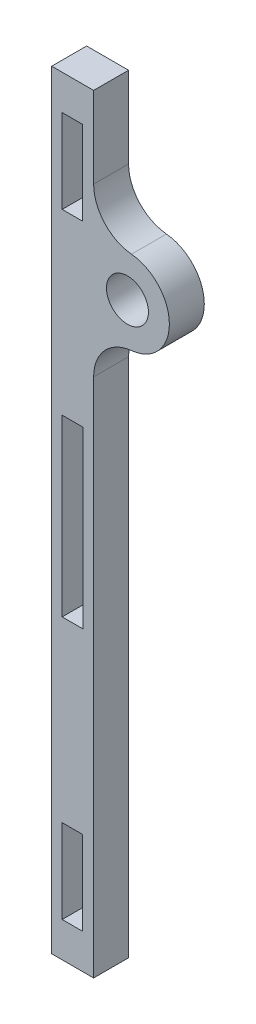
ISO-10303-21;
HEADER;
FILE_DESCRIPTION(('STEP AP214'),'2;1');
FILE_NAME('part.step','',(''),(''),'','','');
FILE_SCHEMA(('AUTOMOTIVE_DESIGN { 1 0 10303 214 1 1 1 1 }'));
ENDSEC;
DATA;
#1=APPLICATION_CONTEXT('core data for automotive mechanical design processes');
#2=APPLICATION_PROTOCOL_DEFINITION('international standard','automotive_design',2000,#1);
#3=PRODUCT_CONTEXT('',#1,'mechanical');
#4=PRODUCT('Part','Part','',(#3));
#5=PRODUCT_RELATED_PRODUCT_CATEGORY('part','',(#4));
#6=PRODUCT_DEFINITION_FORMATION('','',#4);
#7=PRODUCT_DEFINITION_CONTEXT('part definition',#1,'design');
#8=PRODUCT_DEFINITION('design','',#6,#7);
#9=PRODUCT_DEFINITION_SHAPE('','',#8);
#10=(LENGTH_UNIT() NAMED_UNIT(*) SI_UNIT(.MILLI.,.METRE.));
#11=(NAMED_UNIT(*) PLANE_ANGLE_UNIT() SI_UNIT($,.RADIAN.));
#12=(NAMED_UNIT(*) SI_UNIT($,.STERADIAN.) SOLID_ANGLE_UNIT());
#13=UNCERTAINTY_MEASURE_WITH_UNIT(LENGTH_MEASURE(1.E-05),#10,'distance_accuracy_value','');
#14=(GEOMETRIC_REPRESENTATION_CONTEXT(3) GLOBAL_UNCERTAINTY_ASSIGNED_CONTEXT((#13)) GLOBAL_UNIT_ASSIGNED_CONTEXT((#10,
#11,#12)) REPRESENTATION_CONTEXT('',''));
#15=CARTESIAN_POINT('',(0.,0.,0.));
#16=DIRECTION('',(0.,0.,1.));
#17=DIRECTION('',(1.,0.,0.));
#18=AXIS2_PLACEMENT_3D('',#15,#16,#17);
#19=CARTESIAN_POINT('',(-213.099771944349,-16.4582239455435,5.));
#20=DIRECTION('',(0.,0.,1.));
#21=DIRECTION('',(1.,0.,0.));
#22=AXIS2_PLACEMENT_3D('',#19,#20,#21);
#23=PLANE('',#22);
#24=DIRECTION('',(0.,-1.,0.));
#25=VECTOR('',#24,1.);
#26=CARTESIAN_POINT('',(-223.599771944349,-23.4517190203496,5.));
#27=LINE('',#26,#25);
#28=CARTESIAN_POINT('',(-223.599771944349,-23.4517190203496,5.));
#29=VERTEX_POINT('',#28);
#30=CARTESIAN_POINT('',(-223.599771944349,-48.4517190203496,5.));
#31=VERTEX_POINT('',#30);
#32=EDGE_CURVE('E178',#29,#31,#27,.T.);
#33=ORIENTED_EDGE('',*,*,#32,.F.);
#34=DIRECTION('',(-1.,0.,0.));
#35=VECTOR('',#34,1.);
#36=CARTESIAN_POINT('',(-220.599771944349,-23.4517190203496,5.));
#37=LINE('',#36,#35);
#38=CARTESIAN_POINT('',(-220.599771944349,-23.4517190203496,5.));
#39=VERTEX_POINT('',#38);
#40=EDGE_CURVE('E170',#39,#29,#37,.T.);
#41=ORIENTED_EDGE('',*,*,#40,.F.);
#42=DIRECTION('',(0.,1.,0.));
#43=VECTOR('',#42,1.);
#44=CARTESIAN_POINT('',(-220.599771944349,-48.4517190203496,5.));
#45=LINE('',#44,#43);
#46=CARTESIAN_POINT('',(-220.599771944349,-48.4517190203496,5.));
#47=VERTEX_POINT('',#46);
#48=EDGE_CURVE('E193',#47,#39,#45,.T.);
#49=ORIENTED_EDGE('',*,*,#48,.F.);
#50=DIRECTION('',(1.,0.,0.));
#51=VECTOR('',#50,1.);
#52=CARTESIAN_POINT('',(-223.599771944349,-48.4517190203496,5.));
#53=LINE('',#52,#51);
#54=EDGE_CURVE('E191',#31,#47,#53,.T.);
#55=ORIENTED_EDGE('',*,*,#54,.F.);
#56=EDGE_LOOP('',(#33,#41,#49,#55));
#57=FACE_BOUND('',#56,.T.);
#58=DIRECTION('',(1.,0.,0.));
#59=VECTOR('',#58,1.);
#60=CARTESIAN_POINT('',(-223.599771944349,2.04828097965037,5.));
#61=LINE('',#60,#59);
#62=CARTESIAN_POINT('',(-223.599771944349,2.04828097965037,5.));
#63=VERTEX_POINT('',#62);
#64=CARTESIAN_POINT('',(-220.699771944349,2.04828097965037,5.));
#65=VERTEX_POINT('',#64);
#66=EDGE_CURVE('E242',#63,#65,#61,.T.);
#67=ORIENTED_EDGE('',*,*,#66,.F.);
#68=DIRECTION('',(0.,-1.,0.));
#69=VECTOR('',#68,1.);
#70=CARTESIAN_POINT('',(-223.599771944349,14.0482809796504,5.));
#71=LINE('',#70,#69);
#72=CARTESIAN_POINT('',(-223.599771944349,14.0482809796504,5.));
#73=VERTEX_POINT('',#72);
#74=EDGE_CURVE('E240',#73,#63,#71,.T.);
#75=ORIENTED_EDGE('',*,*,#74,.F.);
#76=DIRECTION('',(-1.,0.,0.));
#77=VECTOR('',#76,1.);
#78=CARTESIAN_POINT('',(-223.599771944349,14.0482809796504,5.));
#79=LINE('',#78,#77);
#80=CARTESIAN_POINT('',(-220.699771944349,14.0482809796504,5.));
#81=VERTEX_POINT('',#80);
#82=EDGE_CURVE('E248',#81,#73,#79,.T.);
#83=ORIENTED_EDGE('',*,*,#82,.F.);
#84=DIRECTION('',(0.,1.,0.));
#85=VECTOR('',#84,1.);
#86=CARTESIAN_POINT('',(-220.699771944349,14.0482809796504,5.));
#87=LINE('',#86,#85);
#88=EDGE_CURVE('E245',#65,#81,#87,.T.);
#89=ORIENTED_EDGE('',*,*,#88,.F.);
#90=EDGE_LOOP('',(#67,#75,#83,#89));
#91=FACE_BOUND('',#90,.T.);
#92=DIRECTION('',(0.,-1.,0.));
#93=VECTOR('',#92,1.);
#94=CARTESIAN_POINT('',(-225.099771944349,19.0482809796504,5.));
#95=LINE('',#94,#93);
#96=CARTESIAN_POINT('',(-225.099771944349,19.0482809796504,5.));
#97=VERTEX_POINT('',#96);
#98=CARTESIAN_POINT('',(-225.099771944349,-90.9517190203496,5.));
#99=VERTEX_POINT('',#98);
#100=EDGE_CURVE('E271',#97,#99,#95,.T.);
#101=ORIENTED_EDGE('',*,*,#100,.T.);
#102=DIRECTION('',(1.,0.,0.));
#103=VECTOR('',#102,1.);
#104=CARTESIAN_POINT('',(-225.099771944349,-90.9517190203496,5.));
#105=LINE('',#104,#103);
#106=CARTESIAN_POINT('',(-219.099771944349,-90.9517190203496,5.));
#107=VERTEX_POINT('',#106);
#108=EDGE_CURVE('E274',#99,#107,#105,.T.);
#109=ORIENTED_EDGE('',*,*,#108,.T.);
#110=DIRECTION('',(0.,1.,0.));
#111=VECTOR('',#110,1.);
#112=CARTESIAN_POINT('',(-219.099771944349,-16.4582239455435,5.));
#113=LINE('',#112,#111);
#114=CARTESIAN_POINT('',(-219.099771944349,-16.4582239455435,5.));
#115=VERTEX_POINT('',#114);
#116=EDGE_CURVE('E277',#107,#115,#113,.T.);
#117=ORIENTED_EDGE('',*,*,#116,.T.);
#118=CARTESIAN_POINT('',(-213.099771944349,-16.4582239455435,5.));
#119=DIRECTION('',(0.,0.,-1.));
#120=DIRECTION('',(1.,0.,0.));
#121=AXIS2_PLACEMENT_3D('',#118,#119,#120);
#122=CIRCLE('',#121,6.);
#123=CARTESIAN_POINT('',(-213.680334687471,-10.4863777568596,5.));
#124=VERTEX_POINT('',#123);
#125=EDGE_CURVE('E279',#115,#124,#122,.T.);
#126=ORIENTED_EDGE('',*,*,#125,.T.);
#127=CARTESIAN_POINT('',(-214.260897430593,-4.51453156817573,5.));
#128=DIRECTION('',(0.,0.,1.));
#129=DIRECTION('',(1.,0.,0.));
#130=AXIS2_PLACEMENT_3D('',#127,#128,#129);
#131=CIRCLE('',#130,6.);
#132=CARTESIAN_POINT('',(-213.680334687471,1.45731462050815,5.));
#133=VERTEX_POINT('',#132);
#134=EDGE_CURVE('E281',#124,#133,#131,.T.);
#135=ORIENTED_EDGE('',*,*,#134,.T.);
#136=CARTESIAN_POINT('',(-213.099771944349,7.42916080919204,5.));
#137=DIRECTION('',(0.,0.,-1.));
#138=DIRECTION('',(-1.,0.,0.));
#139=AXIS2_PLACEMENT_3D('',#136,#137,#138);
#140=CIRCLE('',#139,6.);
#141=CARTESIAN_POINT('',(-219.099771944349,7.42916080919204,5.));
#142=VERTEX_POINT('',#141);
#143=EDGE_CURVE('E283',#133,#142,#140,.T.);
#144=ORIENTED_EDGE('',*,*,#143,.T.);
#145=DIRECTION('',(0.,1.,0.));
#146=VECTOR('',#145,1.);
#147=CARTESIAN_POINT('',(-219.099771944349,19.0482809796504,5.));
#148=LINE('',#147,#146);
#149=CARTESIAN_POINT('',(-219.099771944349,19.0482809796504,5.));
#150=VERTEX_POINT('',#149);
#151=EDGE_CURVE('E285',#142,#150,#148,.T.);
#152=ORIENTED_EDGE('',*,*,#151,.T.);
#153=DIRECTION('',(-1.,0.,0.));
#154=VECTOR('',#153,1.);
#155=CARTESIAN_POINT('',(-225.099771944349,19.0482809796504,5.));
#156=LINE('',#155,#154);
#157=EDGE_CURVE('E287',#150,#97,#156,.T.);
#158=ORIENTED_EDGE('',*,*,#157,.T.);
#159=EDGE_LOOP('',(#101,#109,#117,#126,#135,#144,#152,#158));
#160=FACE_BOUND('',#159,.T.);
#161=DIRECTION('',(1.,0.,0.));
#162=VECTOR('',#161,1.);
#163=CARTESIAN_POINT('',(-223.599771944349,-85.9517190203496,5.));
#164=LINE('',#163,#162);
#165=CARTESIAN_POINT('',(-223.599771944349,-85.9517190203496,5.));
#166=VERTEX_POINT('',#165);
#167=CARTESIAN_POINT('',(-220.699771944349,-85.9517190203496,5.));
#168=VERTEX_POINT('',#167);
#169=EDGE_CURVE('E211',#166,#168,#164,.T.);
#170=ORIENTED_EDGE('',*,*,#169,.F.);
#171=DIRECTION('',(0.,-1.,0.));
#172=VECTOR('',#171,1.);
#173=CARTESIAN_POINT('',(-223.599771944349,-73.9517190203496,5.));
#174=LINE('',#173,#172);
#175=CARTESIAN_POINT('',(-223.599771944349,-73.9517190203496,5.));
#176=VERTEX_POINT('',#175);
#177=EDGE_CURVE('E209',#176,#166,#174,.T.);
#178=ORIENTED_EDGE('',*,*,#177,.F.);
#179=DIRECTION('',(-1.,0.,0.));
#180=VECTOR('',#179,1.);
#181=CARTESIAN_POINT('',(-223.599771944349,-73.9517190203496,5.));
#182=LINE('',#181,#180);
#183=CARTESIAN_POINT('',(-220.699771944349,-73.9517190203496,5.));
#184=VERTEX_POINT('',#183);
#185=EDGE_CURVE('E217',#184,#176,#182,.T.);
#186=ORIENTED_EDGE('',*,*,#185,.F.);
#187=DIRECTION('',(0.,1.,0.));
#188=VECTOR('',#187,1.);
#189=CARTESIAN_POINT('',(-220.699771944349,-73.9517190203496,5.));
#190=LINE('',#189,#188);
#191=EDGE_CURVE('E214',#168,#184,#190,.T.);
#192=ORIENTED_EDGE('',*,*,#191,.F.);
#193=EDGE_LOOP('',(#170,#178,#186,#192));
#194=FACE_BOUND('',#193,.T.);
#195=CARTESIAN_POINT('',(-214.260897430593,-4.51453156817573,5.));
#196=DIRECTION('',(0.,0.,1.));
#197=DIRECTION('',(1.,0.,0.));
#198=AXIS2_PLACEMENT_3D('',#195,#196,#197);
#199=CIRCLE('',#198,2.99999999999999);
#200=CARTESIAN_POINT('',(-211.260897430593,-4.51453156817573,5.));
#201=VERTEX_POINT('',#200);
#202=EDGE_CURVE('E199',#201,#201,#199,.T.);
#203=ORIENTED_EDGE('',*,*,#202,.F.);
#204=EDGE_LOOP('',(#203));
#205=FACE_BOUND('',#204,.T.);
#206=ADVANCED_FACE('F33',(#57,#91,#160,#194,#205),#23,.T.);
#207=CARTESIAN_POINT('',(-213.099771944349,-16.4582239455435,0.));
#208=DIRECTION('',(0.,0.,1.));
#209=DIRECTION('',(1.,0.,0.));
#210=AXIS2_PLACEMENT_3D('',#207,#208,#209);
#211=PLANE('',#210);
#212=DIRECTION('',(-1.,0.,0.));
#213=VECTOR('',#212,1.);
#214=CARTESIAN_POINT('',(-220.599771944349,-23.4517190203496,0.));
#215=LINE('',#214,#213);
#216=CARTESIAN_POINT('',(-220.599771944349,-23.4517190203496,0.));
#217=VERTEX_POINT('',#216);
#218=CARTESIAN_POINT('',(-223.599771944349,-23.4517190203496,0.));
#219=VERTEX_POINT('',#218);
#220=EDGE_CURVE('E56',#217,#219,#215,.T.);
#221=ORIENTED_EDGE('',*,*,#220,.T.);
#222=DIRECTION('',(0.,-1.,0.));
#223=VECTOR('',#222,1.);
#224=CARTESIAN_POINT('',(-223.599771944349,-23.4517190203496,0.));
#225=LINE('',#224,#223);
#226=CARTESIAN_POINT('',(-223.599771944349,-48.4517190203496,0.));
#227=VERTEX_POINT('',#226);
#228=EDGE_CURVE('E185',#219,#227,#225,.T.);
#229=ORIENTED_EDGE('',*,*,#228,.T.);
#230=DIRECTION('',(1.,0.,0.));
#231=VECTOR('',#230,1.);
#232=CARTESIAN_POINT('',(-223.599771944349,-48.4517190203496,0.));
#233=LINE('',#232,#231);
#234=CARTESIAN_POINT('',(-220.599771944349,-48.4517190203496,0.));
#235=VERTEX_POINT('',#234);
#236=EDGE_CURVE('E201',#227,#235,#233,.T.);
#237=ORIENTED_EDGE('',*,*,#236,.T.);
#238=DIRECTION('',(0.,1.,0.));
#239=VECTOR('',#238,1.);
#240=CARTESIAN_POINT('',(-220.599771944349,-48.4517190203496,0.));
#241=LINE('',#240,#239);
#242=EDGE_CURVE('E179',#235,#217,#241,.T.);
#243=ORIENTED_EDGE('',*,*,#242,.T.);
#244=EDGE_LOOP('',(#221,#229,#237,#243));
#245=FACE_BOUND('',#244,.T.);
#246=DIRECTION('',(0.,-1.,0.));
#247=VECTOR('',#246,1.);
#248=CARTESIAN_POINT('',(-223.599771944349,14.0482809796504,0.));
#249=LINE('',#248,#247);
#250=CARTESIAN_POINT('',(-223.599771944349,14.0482809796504,0.));
#251=VERTEX_POINT('',#250);
#252=CARTESIAN_POINT('',(-223.599771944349,2.04828097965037,0.));
#253=VERTEX_POINT('',#252);
#254=EDGE_CURVE('E239',#251,#253,#249,.T.);
#255=ORIENTED_EDGE('',*,*,#254,.T.);
#256=DIRECTION('',(1.,0.,0.));
#257=VECTOR('',#256,1.);
#258=CARTESIAN_POINT('',(-223.599771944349,2.04828097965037,0.));
#259=LINE('',#258,#257);
#260=CARTESIAN_POINT('',(-220.699771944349,2.04828097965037,0.));
#261=VERTEX_POINT('',#260);
#262=EDGE_CURVE('E253',#253,#261,#259,.T.);
#263=ORIENTED_EDGE('',*,*,#262,.T.);
#264=DIRECTION('',(0.,1.,0.));
#265=VECTOR('',#264,1.);
#266=CARTESIAN_POINT('',(-220.699771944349,14.0482809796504,0.));
#267=LINE('',#266,#265);
#268=CARTESIAN_POINT('',(-220.699771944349,14.0482809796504,0.));
#269=VERTEX_POINT('',#268);
#270=EDGE_CURVE('E256',#261,#269,#267,.T.);
#271=ORIENTED_EDGE('',*,*,#270,.T.);
#272=DIRECTION('',(-1.,0.,0.));
#273=VECTOR('',#272,1.);
#274=CARTESIAN_POINT('',(-223.599771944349,14.0482809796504,0.));
#275=LINE('',#274,#273);
#276=EDGE_CURVE('E243',#269,#251,#275,.T.);
#277=ORIENTED_EDGE('',*,*,#276,.T.);
#278=EDGE_LOOP('',(#255,#263,#271,#277));
#279=FACE_BOUND('',#278,.T.);
#280=DIRECTION('',(0.,-1.,0.));
#281=VECTOR('',#280,1.);
#282=CARTESIAN_POINT('',(-225.099771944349,19.0482809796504,0.));
#283=LINE('',#282,#281);
#284=CARTESIAN_POINT('',(-225.099771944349,19.0482809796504,0.));
#285=VERTEX_POINT('',#284);
#286=CARTESIAN_POINT('',(-225.099771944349,-90.9517190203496,0.));
#287=VERTEX_POINT('',#286);
#288=EDGE_CURVE('E270',#285,#287,#283,.T.);
#289=ORIENTED_EDGE('',*,*,#288,.F.);
#290=DIRECTION('',(-1.,0.,0.));
#291=VECTOR('',#290,1.);
#292=CARTESIAN_POINT('',(-225.099771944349,19.0482809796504,0.));
#293=LINE('',#292,#291);
#294=CARTESIAN_POINT('',(-219.099771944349,19.0482809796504,0.));
#295=VERTEX_POINT('',#294);
#296=EDGE_CURVE('E275',#295,#285,#293,.T.);
#297=ORIENTED_EDGE('',*,*,#296,.F.);
#298=DIRECTION('',(0.,1.,0.));
#299=VECTOR('',#298,1.);
#300=CARTESIAN_POINT('',(-219.099771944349,19.0482809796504,0.));
#301=LINE('',#300,#299);
#302=CARTESIAN_POINT('',(-219.099771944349,7.42916080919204,0.));
#303=VERTEX_POINT('',#302);
#304=EDGE_CURVE('E302',#303,#295,#301,.T.);
#305=ORIENTED_EDGE('',*,*,#304,.F.);
#306=CARTESIAN_POINT('',(-213.099771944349,7.42916080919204,0.));
#307=DIRECTION('',(0.,0.,-1.));
#308=DIRECTION('',(-1.,0.,0.));
#309=AXIS2_PLACEMENT_3D('',#306,#307,#308);
#310=CIRCLE('',#309,6.);
#311=CARTESIAN_POINT('',(-213.680334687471,1.45731462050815,0.));
#312=VERTEX_POINT('',#311);
#313=EDGE_CURVE('E300',#312,#303,#310,.T.);
#314=ORIENTED_EDGE('',*,*,#313,.F.);
#315=CARTESIAN_POINT('',(-214.260897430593,-4.51453156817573,0.));
#316=DIRECTION('',(0.,0.,1.));
#317=DIRECTION('',(1.,0.,0.));
#318=AXIS2_PLACEMENT_3D('',#315,#316,#317);
#319=CIRCLE('',#318,6.);
#320=CARTESIAN_POINT('',(-213.680334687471,-10.4863777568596,0.));
#321=VERTEX_POINT('',#320);
#322=EDGE_CURVE('E298',#321,#312,#319,.T.);
#323=ORIENTED_EDGE('',*,*,#322,.F.);
#324=CARTESIAN_POINT('',(-213.099771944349,-16.4582239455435,0.));
#325=DIRECTION('',(0.,0.,-1.));
#326=DIRECTION('',(1.,0.,0.));
#327=AXIS2_PLACEMENT_3D('',#324,#325,#326);
#328=CIRCLE('',#327,6.);
#329=CARTESIAN_POINT('',(-219.099771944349,-16.4582239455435,0.));
#330=VERTEX_POINT('',#329);
#331=EDGE_CURVE('E296',#330,#321,#328,.T.);
#332=ORIENTED_EDGE('',*,*,#331,.F.);
#333=DIRECTION('',(0.,1.,0.));
#334=VECTOR('',#333,1.);
#335=CARTESIAN_POINT('',(-219.099771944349,-16.4582239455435,0.));
#336=LINE('',#335,#334);
#337=CARTESIAN_POINT('',(-219.099771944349,-90.9517190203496,0.));
#338=VERTEX_POINT('',#337);
#339=EDGE_CURVE('E294',#338,#330,#336,.T.);
#340=ORIENTED_EDGE('',*,*,#339,.F.);
#341=DIRECTION('',(1.,0.,0.));
#342=VECTOR('',#341,1.);
#343=CARTESIAN_POINT('',(-225.099771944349,-90.9517190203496,0.));
#344=LINE('',#343,#342);
#345=EDGE_CURVE('E292',#287,#338,#344,.T.);
#346=ORIENTED_EDGE('',*,*,#345,.F.);
#347=EDGE_LOOP('',(#289,#297,#305,#314,#323,#332,#340,#346));
#348=FACE_BOUND('',#347,.T.);
#349=DIRECTION('',(0.,-1.,0.));
#350=VECTOR('',#349,1.);
#351=CARTESIAN_POINT('',(-223.599771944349,-73.9517190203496,0.));
#352=LINE('',#351,#350);
#353=CARTESIAN_POINT('',(-223.599771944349,-73.9517190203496,0.));
#354=VERTEX_POINT('',#353);
#355=CARTESIAN_POINT('',(-223.599771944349,-85.9517190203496,0.));
#356=VERTEX_POINT('',#355);
#357=EDGE_CURVE('E186',#354,#356,#352,.T.);
#358=ORIENTED_EDGE('',*,*,#357,.T.);
#359=DIRECTION('',(1.,0.,0.));
#360=VECTOR('',#359,1.);
#361=CARTESIAN_POINT('',(-223.599771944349,-85.9517190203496,0.));
#362=LINE('',#361,#360);
#363=CARTESIAN_POINT('',(-220.699771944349,-85.9517190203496,0.));
#364=VERTEX_POINT('',#363);
#365=EDGE_CURVE('E222',#356,#364,#362,.T.);
#366=ORIENTED_EDGE('',*,*,#365,.T.);
#367=DIRECTION('',(0.,1.,0.));
#368=VECTOR('',#367,1.);
#369=CARTESIAN_POINT('',(-220.699771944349,-73.9517190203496,0.));
#370=LINE('',#369,#368);
#371=CARTESIAN_POINT('',(-220.699771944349,-73.9517190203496,0.));
#372=VERTEX_POINT('',#371);
#373=EDGE_CURVE('E225',#364,#372,#370,.T.);
#374=ORIENTED_EDGE('',*,*,#373,.T.);
#375=DIRECTION('',(-1.,0.,0.));
#376=VECTOR('',#375,1.);
#377=CARTESIAN_POINT('',(-223.599771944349,-73.9517190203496,0.));
#378=LINE('',#377,#376);
#379=EDGE_CURVE('E212',#372,#354,#378,.T.);
#380=ORIENTED_EDGE('',*,*,#379,.T.);
#381=EDGE_LOOP('',(#358,#366,#374,#380));
#382=FACE_BOUND('',#381,.T.);
#383=CARTESIAN_POINT('',(-214.260897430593,-4.51453156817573,0.));
#384=DIRECTION('',(0.,0.,1.));
#385=DIRECTION('',(1.,0.,0.));
#386=AXIS2_PLACEMENT_3D('',#383,#384,#385);
#387=CIRCLE('',#386,2.99999999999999);
#388=CARTESIAN_POINT('',(-211.260897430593,-4.51453156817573,0.));
#389=VERTEX_POINT('',#388);
#390=EDGE_CURVE('E451',#389,#389,#387,.T.);
#391=ORIENTED_EDGE('',*,*,#390,.T.);
#392=EDGE_LOOP('',(#391));
#393=FACE_BOUND('',#392,.T.);
#394=ADVANCED_FACE('F332',(#245,#279,#348,#382,#393),#211,.F.);
#395=CARTESIAN_POINT('',(-225.099771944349,19.0482809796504,5.));
#396=DIRECTION('',(1.,0.,0.));
#397=DIRECTION('',(0.,0.,-1.));
#398=AXIS2_PLACEMENT_3D('',#395,#396,#397);
#399=PLANE('',#398);
#400=ORIENTED_EDGE('',*,*,#288,.T.);
#401=DIRECTION('',(0.,0.,-1.));
#402=VECTOR('',#401,1.);
#403=CARTESIAN_POINT('',(-225.099771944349,-90.9517190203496,5.));
#404=LINE('',#403,#402);
#405=EDGE_CURVE('E11',#99,#287,#404,.T.);
#406=ORIENTED_EDGE('',*,*,#405,.F.);
#407=ORIENTED_EDGE('',*,*,#100,.F.);
#408=DIRECTION('',(0.,0.,-1.));
#409=VECTOR('',#408,1.);
#410=CARTESIAN_POINT('',(-225.099771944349,19.0482809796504,5.));
#411=LINE('',#410,#409);
#412=EDGE_CURVE('E289',#97,#285,#411,.T.);
#413=ORIENTED_EDGE('',*,*,#412,.T.);
#414=EDGE_LOOP('',(#400,#406,#407,#413));
#415=FACE_BOUND('',#414,.T.);
#416=ADVANCED_FACE('F35',(#415),#399,.F.);
#417=CARTESIAN_POINT('',(-225.099771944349,-90.9517190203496,5.));
#418=DIRECTION('',(0.,1.,0.));
#419=DIRECTION('',(0.,0.,1.));
#420=AXIS2_PLACEMENT_3D('',#417,#418,#419);
#421=PLANE('',#420);
#422=ORIENTED_EDGE('',*,*,#345,.T.);
#423=DIRECTION('',(0.,0.,-1.));
#424=VECTOR('',#423,1.);
#425=CARTESIAN_POINT('',(-219.099771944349,-90.9517190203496,5.));
#426=LINE('',#425,#424);
#427=EDGE_CURVE('E41',#107,#338,#426,.T.);
#428=ORIENTED_EDGE('',*,*,#427,.F.);
#429=ORIENTED_EDGE('',*,*,#108,.F.);
#430=ORIENTED_EDGE('',*,*,#405,.T.);
#431=EDGE_LOOP('',(#422,#428,#429,#430));
#432=FACE_BOUND('',#431,.T.);
#433=ADVANCED_FACE('F350',(#432),#421,.F.);
#434=CARTESIAN_POINT('',(-219.099771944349,-16.4582239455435,5.));
#435=DIRECTION('',(-1.,0.,0.));
#436=DIRECTION('',(0.,0.,1.));
#437=AXIS2_PLACEMENT_3D('',#434,#435,#436);
#438=PLANE('',#437);
#439=ORIENTED_EDGE('',*,*,#339,.T.);
#440=DIRECTION('',(0.,0.,-1.));
#441=VECTOR('',#440,1.);
#442=CARTESIAN_POINT('',(-219.099771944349,-16.4582239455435,5.));
#443=LINE('',#442,#441);
#444=EDGE_CURVE('E319',#115,#330,#443,.T.);
#445=ORIENTED_EDGE('',*,*,#444,.F.);
#446=ORIENTED_EDGE('',*,*,#116,.F.);
#447=ORIENTED_EDGE('',*,*,#427,.T.);
#448=EDGE_LOOP('',(#439,#445,#446,#447));
#449=FACE_BOUND('',#448,.T.);
#450=ADVANCED_FACE('F326',(#449),#438,.F.);
#451=CARTESIAN_POINT('',(-213.099771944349,-16.4582239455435,5.));
#452=DIRECTION('',(0.,0.,-1.));
#453=DIRECTION('',(-1.,0.,0.));
#454=AXIS2_PLACEMENT_3D('',#451,#452,#453);
#455=CYLINDRICAL_SURFACE('',#454,6.);
#456=ORIENTED_EDGE('',*,*,#331,.T.);
#457=DIRECTION('',(0.,0.,-1.));
#458=VECTOR('',#457,1.);
#459=CARTESIAN_POINT('',(-213.680334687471,-10.4863777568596,5.));
#460=LINE('',#459,#458);
#461=EDGE_CURVE('E316',#124,#321,#460,.T.);
#462=ORIENTED_EDGE('',*,*,#461,.F.);
#463=ORIENTED_EDGE('',*,*,#125,.F.);
#464=ORIENTED_EDGE('',*,*,#444,.T.);
#465=EDGE_LOOP('',(#456,#462,#463,#464));
#466=FACE_BOUND('',#465,.T.);
#467=ADVANCED_FACE('F338',(#466),#455,.F.);
#468=CARTESIAN_POINT('',(-214.260897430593,-4.51453156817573,5.));
#469=DIRECTION('',(0.,0.,-1.));
#470=DIRECTION('',(-1.,0.,0.));
#471=AXIS2_PLACEMENT_3D('',#468,#469,#470);
#472=CYLINDRICAL_SURFACE('',#471,6.);
#473=ORIENTED_EDGE('',*,*,#322,.T.);
#474=DIRECTION('',(0.,0.,-1.));
#475=VECTOR('',#474,1.);
#476=CARTESIAN_POINT('',(-213.680334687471,1.45731462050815,5.));
#477=LINE('',#476,#475);
#478=EDGE_CURVE('E313',#133,#312,#477,.T.);
#479=ORIENTED_EDGE('',*,*,#478,.F.);
#480=ORIENTED_EDGE('',*,*,#134,.F.);
#481=ORIENTED_EDGE('',*,*,#461,.T.);
#482=EDGE_LOOP('',(#473,#479,#480,#481));
#483=FACE_BOUND('',#482,.T.);
#484=ADVANCED_FACE('F342',(#483),#472,.T.);
#485=CARTESIAN_POINT('',(-213.099771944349,7.42916080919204,5.));
#486=DIRECTION('',(0.,0.,-1.));
#487=DIRECTION('',(-1.,0.,0.));
#488=AXIS2_PLACEMENT_3D('',#485,#486,#487);
#489=CYLINDRICAL_SURFACE('',#488,6.);
#490=ORIENTED_EDGE('',*,*,#313,.T.);
#491=DIRECTION('',(0.,0.,-1.));
#492=VECTOR('',#491,1.);
#493=CARTESIAN_POINT('',(-219.099771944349,7.42916080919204,5.));
#494=LINE('',#493,#492);
#495=EDGE_CURVE('E310',#142,#303,#494,.T.);
#496=ORIENTED_EDGE('',*,*,#495,.F.);
#497=ORIENTED_EDGE('',*,*,#143,.F.);
#498=ORIENTED_EDGE('',*,*,#478,.T.);
#499=EDGE_LOOP('',(#490,#496,#497,#498));
#500=FACE_BOUND('',#499,.T.);
#501=ADVANCED_FACE('F363',(#500),#489,.F.);
#502=CARTESIAN_POINT('',(-219.099771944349,19.0482809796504,5.));
#503=DIRECTION('',(-1.,0.,0.));
#504=DIRECTION('',(0.,0.,1.));
#505=AXIS2_PLACEMENT_3D('',#502,#503,#504);
#506=PLANE('',#505);
#507=ORIENTED_EDGE('',*,*,#304,.T.);
#508=DIRECTION('',(0.,0.,-1.));
#509=VECTOR('',#508,1.);
#510=CARTESIAN_POINT('',(-219.099771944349,19.0482809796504,5.));
#511=LINE('',#510,#509);
#512=EDGE_CURVE('E307',#150,#295,#511,.T.);
#513=ORIENTED_EDGE('',*,*,#512,.F.);
#514=ORIENTED_EDGE('',*,*,#151,.F.);
#515=ORIENTED_EDGE('',*,*,#495,.T.);
#516=EDGE_LOOP('',(#507,#513,#514,#515));
#517=FACE_BOUND('',#516,.T.);
#518=ADVANCED_FACE('F361',(#517),#506,.F.);
#519=CARTESIAN_POINT('',(-225.099771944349,19.0482809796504,5.));
#520=DIRECTION('',(0.,-1.,0.));
#521=DIRECTION('',(0.,0.,-1.));
#522=AXIS2_PLACEMENT_3D('',#519,#520,#521);
#523=PLANE('',#522);
#524=ORIENTED_EDGE('',*,*,#296,.T.);
#525=ORIENTED_EDGE('',*,*,#412,.F.);
#526=ORIENTED_EDGE('',*,*,#157,.F.);
#527=ORIENTED_EDGE('',*,*,#512,.T.);
#528=EDGE_LOOP('',(#524,#525,#526,#527));
#529=FACE_BOUND('',#528,.T.);
#530=ADVANCED_FACE('F356',(#529),#523,.F.);
#531=CARTESIAN_POINT('',(-223.599771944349,14.0482809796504,5.));
#532=DIRECTION('',(1.,0.,0.));
#533=DIRECTION('',(0.,0.,-1.));
#534=AXIS2_PLACEMENT_3D('',#531,#532,#533);
#535=PLANE('',#534);
#536=ORIENTED_EDGE('',*,*,#254,.F.);
#537=DIRECTION('',(0.,0.,-1.));
#538=VECTOR('',#537,1.);
#539=CARTESIAN_POINT('',(-223.599771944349,14.0482809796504,5.));
#540=LINE('',#539,#538);
#541=EDGE_CURVE('E250',#73,#251,#540,.T.);
#542=ORIENTED_EDGE('',*,*,#541,.F.);
#543=ORIENTED_EDGE('',*,*,#74,.T.);
#544=DIRECTION('',(0.,0.,-1.));
#545=VECTOR('',#544,1.);
#546=CARTESIAN_POINT('',(-223.599771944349,2.04828097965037,5.));
#547=LINE('',#546,#545);
#548=EDGE_CURVE('E267',#63,#253,#547,.T.);
#549=ORIENTED_EDGE('',*,*,#548,.T.);
#550=EDGE_LOOP('',(#536,#542,#543,#549));
#551=FACE_BOUND('',#550,.T.);
#552=ADVANCED_FACE('F380',(#551),#535,.T.);
#553=CARTESIAN_POINT('',(-223.599771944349,2.04828097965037,5.));
#554=DIRECTION('',(0.,1.,0.));
#555=DIRECTION('',(-1.,0.,0.));
#556=AXIS2_PLACEMENT_3D('',#553,#554,#555);
#557=PLANE('',#556);
#558=ORIENTED_EDGE('',*,*,#262,.F.);
#559=ORIENTED_EDGE('',*,*,#548,.F.);
#560=ORIENTED_EDGE('',*,*,#66,.T.);
#561=DIRECTION('',(0.,0.,-1.));
#562=VECTOR('',#561,1.);
#563=CARTESIAN_POINT('',(-220.699771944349,2.04828097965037,5.));
#564=LINE('',#563,#562);
#565=EDGE_CURVE('E265',#65,#261,#564,.T.);
#566=ORIENTED_EDGE('',*,*,#565,.T.);
#567=EDGE_LOOP('',(#558,#559,#560,#566));
#568=FACE_BOUND('',#567,.T.);
#569=ADVANCED_FACE('F387',(#568),#557,.T.);
#570=CARTESIAN_POINT('',(-220.699771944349,14.0482809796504,5.));
#571=DIRECTION('',(-1.,0.,0.));
#572=DIRECTION('',(0.,0.,1.));
#573=AXIS2_PLACEMENT_3D('',#570,#571,#572);
#574=PLANE('',#573);
#575=ORIENTED_EDGE('',*,*,#270,.F.);
#576=ORIENTED_EDGE('',*,*,#565,.F.);
#577=ORIENTED_EDGE('',*,*,#88,.T.);
#578=DIRECTION('',(0.,0.,-1.));
#579=VECTOR('',#578,1.);
#580=CARTESIAN_POINT('',(-220.699771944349,14.0482809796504,5.));
#581=LINE('',#580,#579);
#582=EDGE_CURVE('E263',#81,#269,#581,.T.);
#583=ORIENTED_EDGE('',*,*,#582,.T.);
#584=EDGE_LOOP('',(#575,#576,#577,#583));
#585=FACE_BOUND('',#584,.T.);
#586=ADVANCED_FACE('F392',(#585),#574,.T.);
#587=CARTESIAN_POINT('',(-223.599771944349,14.0482809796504,5.));
#588=DIRECTION('',(0.,-1.,0.));
#589=DIRECTION('',(0.,0.,-1.));
#590=AXIS2_PLACEMENT_3D('',#587,#588,#589);
#591=PLANE('',#590);
#592=ORIENTED_EDGE('',*,*,#276,.F.);
#593=ORIENTED_EDGE('',*,*,#582,.F.);
#594=ORIENTED_EDGE('',*,*,#82,.T.);
#595=ORIENTED_EDGE('',*,*,#541,.T.);
#596=EDGE_LOOP('',(#592,#593,#594,#595));
#597=FACE_BOUND('',#596,.T.);
#598=ADVANCED_FACE('F400',(#597),#591,.T.);
#599=CARTESIAN_POINT('',(-223.599771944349,-73.9517190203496,5.));
#600=DIRECTION('',(1.,0.,0.));
#601=DIRECTION('',(0.,0.,-1.));
#602=AXIS2_PLACEMENT_3D('',#599,#600,#601);
#603=PLANE('',#602);
#604=ORIENTED_EDGE('',*,*,#357,.F.);
#605=DIRECTION('',(0.,0.,-1.));
#606=VECTOR('',#605,1.);
#607=CARTESIAN_POINT('',(-223.599771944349,-73.9517190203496,5.));
#608=LINE('',#607,#606);
#609=EDGE_CURVE('E219',#176,#354,#608,.T.);
#610=ORIENTED_EDGE('',*,*,#609,.F.);
#611=ORIENTED_EDGE('',*,*,#177,.T.);
#612=DIRECTION('',(0.,0.,-1.));
#613=VECTOR('',#612,1.);
#614=CARTESIAN_POINT('',(-223.599771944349,-85.9517190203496,5.));
#615=LINE('',#614,#613);
#616=EDGE_CURVE('E236',#166,#356,#615,.T.);
#617=ORIENTED_EDGE('',*,*,#616,.T.);
#618=EDGE_LOOP('',(#604,#610,#611,#617));
#619=FACE_BOUND('',#618,.T.);
#620=ADVANCED_FACE('F412',(#619),#603,.T.);
#621=CARTESIAN_POINT('',(-223.599771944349,-85.9517190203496,5.));
#622=DIRECTION('',(0.,1.,0.));
#623=DIRECTION('',(0.,0.,1.));
#624=AXIS2_PLACEMENT_3D('',#621,#622,#623);
#625=PLANE('',#624);
#626=ORIENTED_EDGE('',*,*,#365,.F.);
#627=ORIENTED_EDGE('',*,*,#616,.F.);
#628=ORIENTED_EDGE('',*,*,#169,.T.);
#629=DIRECTION('',(0.,0.,-1.));
#630=VECTOR('',#629,1.);
#631=CARTESIAN_POINT('',(-220.699771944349,-85.9517190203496,5.));
#632=LINE('',#631,#630);
#633=EDGE_CURVE('E234',#168,#364,#632,.T.);
#634=ORIENTED_EDGE('',*,*,#633,.T.);
#635=EDGE_LOOP('',(#626,#627,#628,#634));
#636=FACE_BOUND('',#635,.T.);
#637=ADVANCED_FACE('F417',(#636),#625,.T.);
#638=CARTESIAN_POINT('',(-220.699771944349,-73.9517190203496,5.));
#639=DIRECTION('',(-1.,0.,0.));
#640=DIRECTION('',(0.,0.,1.));
#641=AXIS2_PLACEMENT_3D('',#638,#639,#640);
#642=PLANE('',#641);
#643=ORIENTED_EDGE('',*,*,#373,.F.);
#644=ORIENTED_EDGE('',*,*,#633,.F.);
#645=ORIENTED_EDGE('',*,*,#191,.T.);
#646=DIRECTION('',(0.,0.,-1.));
#647=VECTOR('',#646,1.);
#648=CARTESIAN_POINT('',(-220.699771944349,-73.9517190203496,5.));
#649=LINE('',#648,#647);
#650=EDGE_CURVE('E232',#184,#372,#649,.T.);
#651=ORIENTED_EDGE('',*,*,#650,.T.);
#652=EDGE_LOOP('',(#643,#644,#645,#651));
#653=FACE_BOUND('',#652,.T.);
#654=ADVANCED_FACE('F421',(#653),#642,.T.);
#655=CARTESIAN_POINT('',(-223.599771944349,-73.9517190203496,5.));
#656=DIRECTION('',(0.,-1.,0.));
#657=DIRECTION('',(0.,0.,-1.));
#658=AXIS2_PLACEMENT_3D('',#655,#656,#657);
#659=PLANE('',#658);
#660=ORIENTED_EDGE('',*,*,#379,.F.);
#661=ORIENTED_EDGE('',*,*,#650,.F.);
#662=ORIENTED_EDGE('',*,*,#185,.T.);
#663=ORIENTED_EDGE('',*,*,#609,.T.);
#664=EDGE_LOOP('',(#660,#661,#662,#663));
#665=FACE_BOUND('',#664,.T.);
#666=ADVANCED_FACE('F425',(#665),#659,.T.);
#667=CARTESIAN_POINT('',(-220.599771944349,-23.4517190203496,5.));
#668=DIRECTION('',(0.,-1.,0.));
#669=DIRECTION('',(0.,0.,-1.));
#670=AXIS2_PLACEMENT_3D('',#667,#668,#669);
#671=PLANE('',#670);
#672=ORIENTED_EDGE('',*,*,#220,.F.);
#673=DIRECTION('',(0.,0.,-1.));
#674=VECTOR('',#673,1.);
#675=CARTESIAN_POINT('',(-220.599771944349,-23.4517190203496,5.));
#676=LINE('',#675,#674);
#677=EDGE_CURVE('E174',#39,#217,#676,.T.);
#678=ORIENTED_EDGE('',*,*,#677,.F.);
#679=ORIENTED_EDGE('',*,*,#40,.T.);
#680=DIRECTION('',(0.,0.,-1.));
#681=VECTOR('',#680,1.);
#682=CARTESIAN_POINT('',(-223.599771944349,-23.4517190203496,5.));
#683=LINE('',#682,#681);
#684=EDGE_CURVE('E173',#29,#219,#683,.T.);
#685=ORIENTED_EDGE('',*,*,#684,.T.);
#686=EDGE_LOOP('',(#672,#678,#679,#685));
#687=FACE_BOUND('',#686,.T.);
#688=ADVANCED_FACE('F172',(#687),#671,.T.);
#689=CARTESIAN_POINT('',(-223.599771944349,-23.4517190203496,5.));
#690=DIRECTION('',(1.,0.,0.));
#691=DIRECTION('',(0.,0.,-1.));
#692=AXIS2_PLACEMENT_3D('',#689,#690,#691);
#693=PLANE('',#692);
#694=ORIENTED_EDGE('',*,*,#228,.F.);
#695=ORIENTED_EDGE('',*,*,#684,.F.);
#696=ORIENTED_EDGE('',*,*,#32,.T.);
#697=DIRECTION('',(0.,0.,-1.));
#698=VECTOR('',#697,1.);
#699=CARTESIAN_POINT('',(-223.599771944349,-48.4517190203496,5.));
#700=LINE('',#699,#698);
#701=EDGE_CURVE('E187',#31,#227,#700,.T.);
#702=ORIENTED_EDGE('',*,*,#701,.T.);
#703=EDGE_LOOP('',(#694,#695,#696,#702));
#704=FACE_BOUND('',#703,.T.);
#705=ADVANCED_FACE('F182',(#704),#693,.T.);
#706=CARTESIAN_POINT('',(-223.599771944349,-48.4517190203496,5.));
#707=DIRECTION('',(0.,1.,0.));
#708=DIRECTION('',(0.,0.,1.));
#709=AXIS2_PLACEMENT_3D('',#706,#707,#708);
#710=PLANE('',#709);
#711=ORIENTED_EDGE('',*,*,#236,.F.);
#712=ORIENTED_EDGE('',*,*,#701,.F.);
#713=ORIENTED_EDGE('',*,*,#54,.T.);
#714=DIRECTION('',(0.,0.,-1.));
#715=VECTOR('',#714,1.);
#716=CARTESIAN_POINT('',(-220.599771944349,-48.4517190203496,5.));
#717=LINE('',#716,#715);
#718=EDGE_CURVE('E48',#47,#235,#717,.T.);
#719=ORIENTED_EDGE('',*,*,#718,.T.);
#720=EDGE_LOOP('',(#711,#712,#713,#719));
#721=FACE_BOUND('',#720,.T.);
#722=ADVANCED_FACE('F434',(#721),#710,.T.);
#723=CARTESIAN_POINT('',(-220.599771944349,-48.4517190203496,5.));
#724=DIRECTION('',(-1.,0.,0.));
#725=DIRECTION('',(0.,0.,1.));
#726=AXIS2_PLACEMENT_3D('',#723,#724,#725);
#727=PLANE('',#726);
#728=ORIENTED_EDGE('',*,*,#242,.F.);
#729=ORIENTED_EDGE('',*,*,#718,.F.);
#730=ORIENTED_EDGE('',*,*,#48,.T.);
#731=ORIENTED_EDGE('',*,*,#677,.T.);
#732=EDGE_LOOP('',(#728,#729,#730,#731));
#733=FACE_BOUND('',#732,.T.);
#734=ADVANCED_FACE('F437',(#733),#727,.T.);
#735=CARTESIAN_POINT('',(-214.260897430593,-4.51453156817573,5.));
#736=DIRECTION('',(0.,0.,-1.));
#737=DIRECTION('',(-1.,0.,0.));
#738=AXIS2_PLACEMENT_3D('',#735,#736,#737);
#739=CYLINDRICAL_SURFACE('',#738,2.99999999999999);
#740=ORIENTED_EDGE('',*,*,#202,.T.);
#741=EDGE_LOOP('',(#740));
#742=FACE_BOUND('',#741,.T.);
#743=ORIENTED_EDGE('',*,*,#390,.F.);
#744=EDGE_LOOP('',(#743));
#745=FACE_BOUND('',#744,.T.);
#746=ADVANCED_FACE('F441',(#742,#745),#739,.F.);
#747=CLOSED_SHELL('',(#206,#394,#416,#433,#450,#467,#484,#501,#518,#530,#552,#569,#586,#598,
#620,#637,#654,#666,#688,#705,#722,#734,#746));
#748=MANIFOLD_SOLID_BREP('B2',#747);
#749=ADVANCED_BREP_SHAPE_REPRESENTATION('',(#18,#748),#14);
#750=SHAPE_DEFINITION_REPRESENTATION(#9,#749);
ENDSEC;
END-ISO-10303-21;
